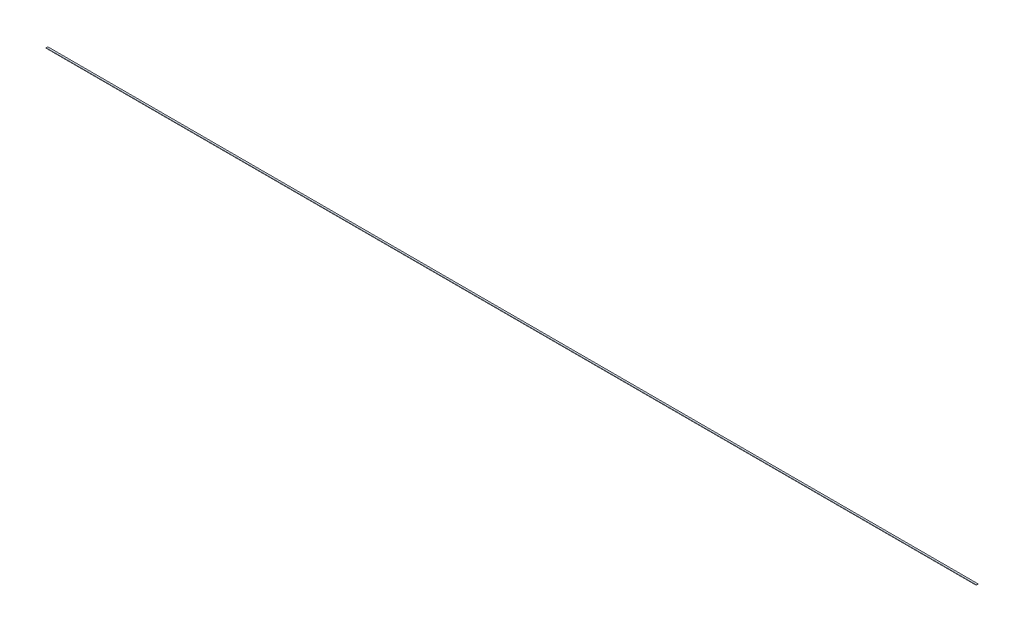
ISO-10303-21;
HEADER;
FILE_DESCRIPTION(('STEP AP214'),'2;1');
FILE_NAME('part.step','',(''),(''),'','','');
FILE_SCHEMA(('AUTOMOTIVE_DESIGN { 1 0 10303 214 1 1 1 1 }'));
ENDSEC;
DATA;
#1=APPLICATION_CONTEXT('core data for automotive mechanical design processes');
#2=APPLICATION_PROTOCOL_DEFINITION('international standard','automotive_design',2000,#1);
#3=PRODUCT_CONTEXT('',#1,'mechanical');
#4=PRODUCT('Part','Part','',(#3));
#5=PRODUCT_RELATED_PRODUCT_CATEGORY('part','',(#4));
#6=PRODUCT_DEFINITION_FORMATION('','',#4);
#7=PRODUCT_DEFINITION_CONTEXT('part definition',#1,'design');
#8=PRODUCT_DEFINITION('design','',#6,#7);
#9=PRODUCT_DEFINITION_SHAPE('','',#8);
#10=(LENGTH_UNIT() NAMED_UNIT(*) SI_UNIT(.MILLI.,.METRE.));
#11=(NAMED_UNIT(*) PLANE_ANGLE_UNIT() SI_UNIT($,.RADIAN.));
#12=(NAMED_UNIT(*) SI_UNIT($,.STERADIAN.) SOLID_ANGLE_UNIT());
#13=UNCERTAINTY_MEASURE_WITH_UNIT(LENGTH_MEASURE(1.E-05),#10,'distance_accuracy_value','');
#14=(GEOMETRIC_REPRESENTATION_CONTEXT(3) GLOBAL_UNCERTAINTY_ASSIGNED_CONTEXT((#13)) GLOBAL_UNIT_ASSIGNED_CONTEXT((#10,
#11,#12)) REPRESENTATION_CONTEXT('',''));
#15=CARTESIAN_POINT('',(0.,0.,0.));
#16=DIRECTION('',(0.,0.,1.));
#17=DIRECTION('',(1.,0.,0.));
#18=AXIS2_PLACEMENT_3D('',#15,#16,#17);
#19=CARTESIAN_POINT('',(-13898.943391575,5258.80168228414,1000.));
#20=DIRECTION('',(1.,0.,0.));
#21=DIRECTION('',(0.,1.,0.));
#22=AXIS2_PLACEMENT_3D('',#19,#20,#21);
#23=PLANE('',#22);
#24=DIRECTION('',(0.,-1.,0.));
#25=VECTOR('',#24,1.);
#26=CARTESIAN_POINT('',(-13898.943391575,5258.80168228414,0.));
#27=LINE('',#26,#25);
#28=CARTESIAN_POINT('',(-13898.943391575,5258.80168228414,0.));
#29=VERTEX_POINT('',#28);
#30=CARTESIAN_POINT('',(-13898.943391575,5058.80168228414,0.));
#31=VERTEX_POINT('',#30);
#32=EDGE_CURVE('E99',#29,#31,#27,.T.);
#33=ORIENTED_EDGE('',*,*,#32,.T.);
#34=DIRECTION('',(0.,0.,-1.));
#35=VECTOR('',#34,1.);
#36=CARTESIAN_POINT('',(-13898.943391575,5058.80168228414,1000.));
#37=LINE('',#36,#35);
#38=CARTESIAN_POINT('',(-13898.943391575,5058.80168228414,1000.));
#39=VERTEX_POINT('',#38);
#40=EDGE_CURVE('E11',#39,#31,#37,.T.);
#41=ORIENTED_EDGE('',*,*,#40,.F.);
#42=DIRECTION('',(0.,-1.,0.));
#43=VECTOR('',#42,1.);
#44=CARTESIAN_POINT('',(-13898.943391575,5258.80168228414,1000.));
#45=LINE('',#44,#43);
#46=CARTESIAN_POINT('',(-13898.943391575,5258.80168228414,1000.));
#47=VERTEX_POINT('',#46);
#48=EDGE_CURVE('E87',#47,#39,#45,.T.);
#49=ORIENTED_EDGE('',*,*,#48,.F.);
#50=DIRECTION('',(0.,0.,-1.));
#51=VECTOR('',#50,1.);
#52=CARTESIAN_POINT('',(-13898.943391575,5258.80168228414,1000.));
#53=LINE('',#52,#51);
#54=EDGE_CURVE('E95',#47,#29,#53,.T.);
#55=ORIENTED_EDGE('',*,*,#54,.T.);
#56=EDGE_LOOP('',(#33,#41,#49,#55));
#57=FACE_BOUND('',#56,.T.);
#58=ADVANCED_FACE('F36',(#57),#23,.F.);
#59=CARTESIAN_POINT('',(496101.056608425,5058.8016822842,1000.));
#60=DIRECTION('',(0.,1.,0.));
#61=DIRECTION('',(-1.,0.,0.));
#62=AXIS2_PLACEMENT_3D('',#59,#60,#61);
#63=PLANE('',#62);
#64=DIRECTION('',(1.,0.,0.));
#65=VECTOR('',#64,1.);
#66=CARTESIAN_POINT('',(496101.056608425,5058.8016822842,0.));
#67=LINE('',#66,#65);
#68=CARTESIAN_POINT('',(496101.056608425,5058.8016822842,0.));
#69=VERTEX_POINT('',#68);
#70=EDGE_CURVE('E91',#31,#69,#67,.T.);
#71=ORIENTED_EDGE('',*,*,#70,.T.);
#72=DIRECTION('',(0.,0.,-1.));
#73=VECTOR('',#72,1.);
#74=CARTESIAN_POINT('',(496101.056608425,5058.8016822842,1000.));
#75=LINE('',#74,#73);
#76=CARTESIAN_POINT('',(496101.056608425,5058.8016822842,1000.));
#77=VERTEX_POINT('',#76);
#78=EDGE_CURVE('E44',#77,#69,#75,.T.);
#79=ORIENTED_EDGE('',*,*,#78,.F.);
#80=DIRECTION('',(1.,0.,0.));
#81=VECTOR('',#80,1.);
#82=CARTESIAN_POINT('',(496101.056608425,5058.8016822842,1000.));
#83=LINE('',#82,#81);
#84=EDGE_CURVE('E82',#39,#77,#83,.T.);
#85=ORIENTED_EDGE('',*,*,#84,.F.);
#86=ORIENTED_EDGE('',*,*,#40,.T.);
#87=EDGE_LOOP('',(#71,#79,#85,#86));
#88=FACE_BOUND('',#87,.T.);
#89=ADVANCED_FACE('F90',(#88),#63,.F.);
#90=CARTESIAN_POINT('',(496101.056608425,5058.8016822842,1000.));
#91=DIRECTION('',(-1.,0.,0.));
#92=DIRECTION('',(0.,0.,1.));
#93=AXIS2_PLACEMENT_3D('',#90,#91,#92);
#94=PLANE('',#93);
#95=DIRECTION('',(0.,1.,0.));
#96=VECTOR('',#95,1.);
#97=CARTESIAN_POINT('',(496101.056608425,5058.8016822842,0.));
#98=LINE('',#97,#96);
#99=CARTESIAN_POINT('',(496101.056608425,5258.8016822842,0.));
#100=VERTEX_POINT('',#99);
#101=EDGE_CURVE('E69',#69,#100,#98,.T.);
#102=ORIENTED_EDGE('',*,*,#101,.T.);
#103=DIRECTION('',(0.,0.,-1.));
#104=VECTOR('',#103,1.);
#105=CARTESIAN_POINT('',(496101.056608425,5258.8016822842,1000.));
#106=LINE('',#105,#104);
#107=CARTESIAN_POINT('',(496101.056608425,5258.8016822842,1000.));
#108=VERTEX_POINT('',#107);
#109=EDGE_CURVE('E92',#108,#100,#106,.T.);
#110=ORIENTED_EDGE('',*,*,#109,.F.);
#111=DIRECTION('',(0.,1.,0.));
#112=VECTOR('',#111,1.);
#113=CARTESIAN_POINT('',(496101.056608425,5058.8016822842,1000.));
#114=LINE('',#113,#112);
#115=EDGE_CURVE('E85',#77,#108,#114,.T.);
#116=ORIENTED_EDGE('',*,*,#115,.F.);
#117=ORIENTED_EDGE('',*,*,#78,.T.);
#118=EDGE_LOOP('',(#102,#110,#116,#117));
#119=FACE_BOUND('',#118,.T.);
#120=ADVANCED_FACE('F93',(#119),#94,.F.);
#121=CARTESIAN_POINT('',(496101.056608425,5258.8016822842,1000.));
#122=DIRECTION('',(0.,-1.,0.));
#123=DIRECTION('',(1.,0.,0.));
#124=AXIS2_PLACEMENT_3D('',#121,#122,#123);
#125=PLANE('',#124);
#126=DIRECTION('',(-1.,0.,0.));
#127=VECTOR('',#126,1.);
#128=CARTESIAN_POINT('',(496101.056608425,5258.8016822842,0.));
#129=LINE('',#128,#127);
#130=EDGE_CURVE('E75',#100,#29,#129,.T.);
#131=ORIENTED_EDGE('',*,*,#130,.T.);
#132=ORIENTED_EDGE('',*,*,#54,.F.);
#133=DIRECTION('',(-1.,0.,0.));
#134=VECTOR('',#133,1.);
#135=CARTESIAN_POINT('',(496101.056608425,5258.8016822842,1000.));
#136=LINE('',#135,#134);
#137=EDGE_CURVE('E52',#108,#47,#136,.T.);
#138=ORIENTED_EDGE('',*,*,#137,.F.);
#139=ORIENTED_EDGE('',*,*,#109,.T.);
#140=EDGE_LOOP('',(#131,#132,#138,#139));
#141=FACE_BOUND('',#140,.T.);
#142=ADVANCED_FACE('F106',(#141),#125,.F.);
#143=CARTESIAN_POINT('',(0.,0.,1000.));
#144=DIRECTION('',(0.,0.,-1.));
#145=DIRECTION('',(-1.,0.,0.));
#146=AXIS2_PLACEMENT_3D('',#143,#144,#145);
#147=PLANE('',#146);
#148=ORIENTED_EDGE('',*,*,#48,.T.);
#149=ORIENTED_EDGE('',*,*,#84,.T.);
#150=ORIENTED_EDGE('',*,*,#115,.T.);
#151=ORIENTED_EDGE('',*,*,#137,.T.);
#152=EDGE_LOOP('',(#148,#149,#150,#151));
#153=FACE_BOUND('',#152,.T.);
#154=ADVANCED_FACE('F83',(#153),#147,.F.);
#155=CARTESIAN_POINT('',(0.,0.,0.));
#156=DIRECTION('',(0.,0.,-1.));
#157=DIRECTION('',(-1.,0.,0.));
#158=AXIS2_PLACEMENT_3D('',#155,#156,#157);
#159=PLANE('',#158);
#160=ORIENTED_EDGE('',*,*,#32,.F.);
#161=ORIENTED_EDGE('',*,*,#130,.F.);
#162=ORIENTED_EDGE('',*,*,#101,.F.);
#163=ORIENTED_EDGE('',*,*,#70,.F.);
#164=EDGE_LOOP('',(#160,#161,#162,#163));
#165=FACE_BOUND('',#164,.T.);
#166=ADVANCED_FACE('F109',(#165),#159,.T.);
#167=CLOSED_SHELL('',(#58,#89,#120,#142,#154,#166));
#168=MANIFOLD_SOLID_BREP('B2',#167);
#169=ADVANCED_BREP_SHAPE_REPRESENTATION('',(#18,#168),#14);
#170=SHAPE_DEFINITION_REPRESENTATION(#9,#169);
ENDSEC;
END-ISO-10303-21;
